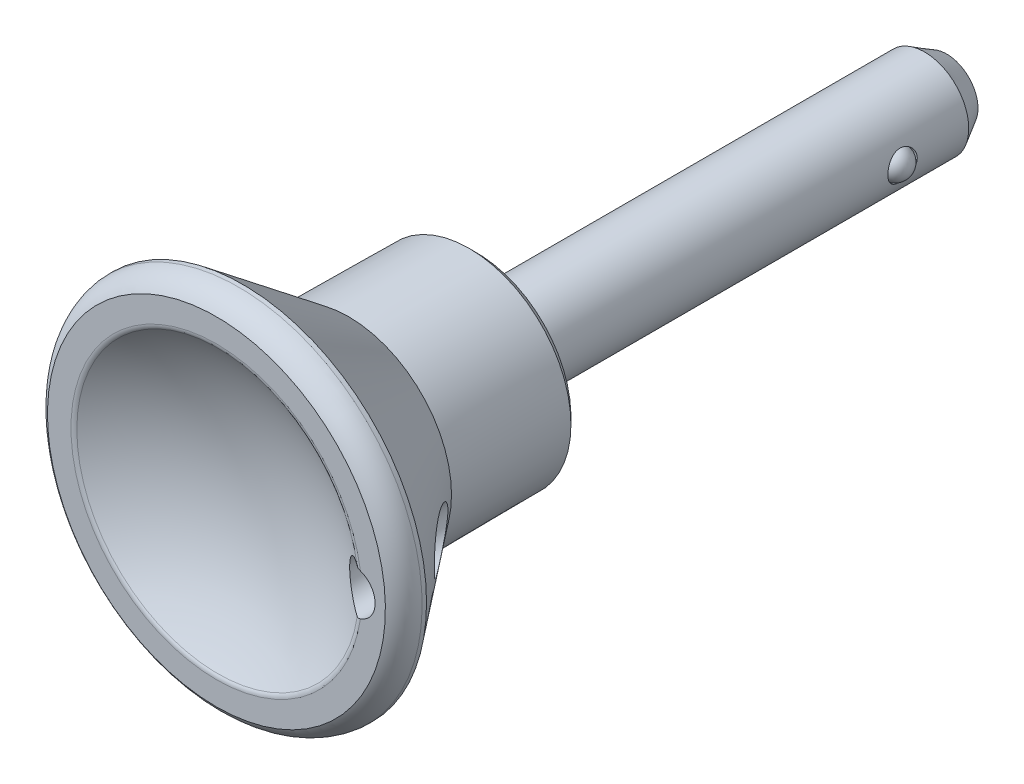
ISO-10303-21;
HEADER;
FILE_DESCRIPTION(('STEP AP214'),'2;1');
FILE_NAME('part.step','',(''),(''),'','','');
FILE_SCHEMA(('AUTOMOTIVE_DESIGN { 1 0 10303 214 1 1 1 1 }'));
ENDSEC;
DATA;
#1=APPLICATION_CONTEXT('core data for automotive mechanical design processes');
#2=APPLICATION_PROTOCOL_DEFINITION('international standard','automotive_design',2000,#1);
#3=PRODUCT_CONTEXT('',#1,'mechanical');
#4=PRODUCT('Part','Part','',(#3));
#5=PRODUCT_RELATED_PRODUCT_CATEGORY('part','',(#4));
#6=PRODUCT_DEFINITION_FORMATION('','',#4);
#7=PRODUCT_DEFINITION_CONTEXT('part definition',#1,'design');
#8=PRODUCT_DEFINITION('design','',#6,#7);
#9=PRODUCT_DEFINITION_SHAPE('','',#8);
#10=(LENGTH_UNIT() NAMED_UNIT(*) SI_UNIT(.MILLI.,.METRE.));
#11=(NAMED_UNIT(*) PLANE_ANGLE_UNIT() SI_UNIT($,.RADIAN.));
#12=(NAMED_UNIT(*) SI_UNIT($,.STERADIAN.) SOLID_ANGLE_UNIT());
#13=UNCERTAINTY_MEASURE_WITH_UNIT(LENGTH_MEASURE(1.E-05),#10,'distance_accuracy_value','');
#14=(GEOMETRIC_REPRESENTATION_CONTEXT(3) GLOBAL_UNCERTAINTY_ASSIGNED_CONTEXT((#13)) GLOBAL_UNIT_ASSIGNED_CONTEXT((#10,
#11,#12)) REPRESENTATION_CONTEXT('',''));
#15=CARTESIAN_POINT('',(0.,0.,0.));
#16=DIRECTION('',(0.,0.,1.));
#17=DIRECTION('',(1.,0.,0.));
#18=AXIS2_PLACEMENT_3D('',#15,#16,#17);
#19=CARTESIAN_POINT('',(0.,0.,0.));
#20=DIRECTION('',(0.,0.,1.));
#21=DIRECTION('',(0.,-1.,0.));
#22=AXIS2_PLACEMENT_3D('',#19,#20,#21);
#23=CYLINDRICAL_SURFACE('',#22,3.);
#24=CARTESIAN_POINT('',(0.,0.,0.));
#25=DIRECTION('',(0.,0.,1.));
#26=DIRECTION('',(0.,-1.,0.));
#27=AXIS2_PLACEMENT_3D('',#24,#25,#26);
#28=CIRCLE('',#27,3.);
#29=CARTESIAN_POINT('',(0.,-3.,0.));
#30=VERTEX_POINT('',#29);
#31=EDGE_CURVE('E17',#30,#30,#28,.T.);
#32=ORIENTED_EDGE('',*,*,#31,.F.);
#33=EDGE_LOOP('',(#32));
#34=FACE_BOUND('',#33,.T.);
#35=CARTESIAN_POINT('',(0.,0.,-30.5));
#36=DIRECTION('',(0.,0.,1.));
#37=DIRECTION('',(1.,0.,0.));
#38=AXIS2_PLACEMENT_3D('',#35,#36,#37);
#39=CIRCLE('',#38,3.);
#40=CARTESIAN_POINT('',(3.,0.,-30.5));
#41=VERTEX_POINT('',#40);
#42=EDGE_CURVE('E106',#41,#41,#39,.T.);
#43=ORIENTED_EDGE('',*,*,#42,.T.);
#44=EDGE_LOOP('',(#43));
#45=FACE_BOUND('',#44,.T.);
#46=CARTESIAN_POINT('',(3.,0.,-27.));
#47=CARTESIAN_POINT('',(2.99999782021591,-0.0544873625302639,-26.9999969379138));
#48=CARTESIAN_POINT('',(2.99849945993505,-0.10903081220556,-26.9955259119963));
#49=CARTESIAN_POINT('',(2.99265949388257,-0.21656775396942,-26.9777925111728));
#50=CARTESIAN_POINT('',(2.98831315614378,-0.269558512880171,-26.9645155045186));
#51=CARTESIAN_POINT('',(2.9772520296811,-0.372338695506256,-26.9296777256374));
#52=CARTESIAN_POINT('',(2.97054267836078,-0.42213516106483,-26.9081359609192));
#53=CARTESIAN_POINT('',(2.95544181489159,-0.517390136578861,-26.8574495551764));
#54=CARTESIAN_POINT('',(2.94705050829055,-0.562849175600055,-26.8283058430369));
#55=CARTESIAN_POINT('',(2.9291411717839,-0.649740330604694,-26.7621750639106));
#56=CARTESIAN_POINT('',(2.9195960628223,-0.691001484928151,-26.7249707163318));
#57=CARTESIAN_POINT('',(2.90060364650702,-0.766830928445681,-26.6442351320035));
#58=CARTESIAN_POINT('',(2.89115636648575,-0.801397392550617,-26.6007021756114));
#59=CARTESIAN_POINT('',(2.87313330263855,-0.863825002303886,-26.5070147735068));
#60=CARTESIAN_POINT('',(2.86459035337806,-0.891464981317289,-26.4567060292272));
#61=CARTESIAN_POINT('',(2.84975302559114,-0.937818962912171,-26.3518236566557));
#62=CARTESIAN_POINT('',(2.84345795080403,-0.956535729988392,-26.29725135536));
#63=CARTESIAN_POINT('',(2.83411303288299,-0.983873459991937,-26.187326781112));
#64=CARTESIAN_POINT('',(2.83096095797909,-0.992813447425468,-26.1320627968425));
#65=CARTESIAN_POINT('',(2.82795656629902,-1.00134112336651,-26.020736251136));
#66=CARTESIAN_POINT('',(2.82810323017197,-1.00093170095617,-25.9646739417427));
#67=CARTESIAN_POINT('',(2.83159014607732,-0.991019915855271,-25.8560634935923));
#68=CARTESIAN_POINT('',(2.83478414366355,-0.981933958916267,-25.8034718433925));
#69=CARTESIAN_POINT('',(2.84376655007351,-0.95560624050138,-25.7006068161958));
#70=CARTESIAN_POINT('',(2.84955528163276,-0.938363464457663,-25.6503337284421));
#71=CARTESIAN_POINT('',(2.8631792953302,-0.895938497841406,-25.5525859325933));
#72=CARTESIAN_POINT('',(2.87104608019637,-0.870632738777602,-25.5051694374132));
#73=CARTESIAN_POINT('',(2.88792606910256,-0.812887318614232,-25.4151267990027));
#74=CARTESIAN_POINT('',(2.89693954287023,-0.780445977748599,-25.3725017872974));
#75=CARTESIAN_POINT('',(2.91567165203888,-0.707355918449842,-25.2909155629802));
#76=CARTESIAN_POINT('',(2.92540257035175,-0.666367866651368,-25.2522605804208));
#77=CARTESIAN_POINT('',(2.94406631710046,-0.5783549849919,-25.1822794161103));
#78=CARTESIAN_POINT('',(2.95299879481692,-0.53132752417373,-25.1509564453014));
#79=CARTESIAN_POINT('',(2.96917806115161,-0.431907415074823,-25.0962803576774));
#80=CARTESIAN_POINT('',(2.97640595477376,-0.379463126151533,-25.073015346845));
#81=CARTESIAN_POINT('',(2.98821351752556,-0.271163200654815,-25.0357719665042));
#82=CARTESIAN_POINT('',(2.99279860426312,-0.215314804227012,-25.0217745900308));
#83=CARTESIAN_POINT('',(2.99719039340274,-0.13245787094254,-25.0084544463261));
#84=CARTESIAN_POINT('',(2.99824082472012,-0.106081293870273,-25.0052879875));
#85=CARTESIAN_POINT('',(2.9996461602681,-0.0531409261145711,-25.0010600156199));
#86=CARTESIAN_POINT('',(3.00000106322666,-0.0265771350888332,-24.9999985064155));
#87=CARTESIAN_POINT('',(2.99999782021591,0.0544873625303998,-25.0000030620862));
#88=CARTESIAN_POINT('',(2.99849945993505,0.109030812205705,-25.0044740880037));
#89=CARTESIAN_POINT('',(2.99265949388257,0.216567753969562,-25.0222074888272));
#90=CARTESIAN_POINT('',(2.98831315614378,0.269558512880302,-25.0354844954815));
#91=CARTESIAN_POINT('',(2.9772520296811,0.372338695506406,-25.0703222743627));
#92=CARTESIAN_POINT('',(2.97054267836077,0.422135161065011,-25.0918640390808));
#93=CARTESIAN_POINT('',(2.95544181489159,0.517390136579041,-25.1425504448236));
#94=CARTESIAN_POINT('',(2.94705050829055,0.562849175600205,-25.1716941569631));
#95=CARTESIAN_POINT('',(2.9291411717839,0.649740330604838,-25.2378249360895));
#96=CARTESIAN_POINT('',(2.91959606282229,0.691001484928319,-25.2750292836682));
#97=CARTESIAN_POINT('',(2.90060364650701,0.76683092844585,-25.3557648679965));
#98=CARTESIAN_POINT('',(2.89115636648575,0.801397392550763,-25.3992978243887));
#99=CARTESIAN_POINT('',(2.87313330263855,0.863825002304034,-25.4929852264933));
#100=CARTESIAN_POINT('',(2.86459035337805,0.891464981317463,-25.5432939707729));
#101=CARTESIAN_POINT('',(2.84975302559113,0.937818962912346,-25.6481763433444));
#102=CARTESIAN_POINT('',(2.84345795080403,0.956535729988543,-25.7027486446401));
#103=CARTESIAN_POINT('',(2.834113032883,0.983873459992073,-25.8126732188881));
#104=CARTESIAN_POINT('',(2.83096095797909,0.992813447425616,-25.8679372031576));
#105=CARTESIAN_POINT('',(2.82795656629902,1.00134112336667,-25.9792637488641));
#106=CARTESIAN_POINT('',(2.82810323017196,1.00093170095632,-26.0353260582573));
#107=CARTESIAN_POINT('',(2.83159014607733,0.991019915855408,-26.1439365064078));
#108=CARTESIAN_POINT('',(2.83478414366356,0.98193395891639,-26.1965281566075));
#109=CARTESIAN_POINT('',(2.84376655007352,0.955606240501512,-26.2993931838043));
#110=CARTESIAN_POINT('',(2.84955528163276,0.938363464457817,-26.349666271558));
#111=CARTESIAN_POINT('',(2.86317929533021,0.895938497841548,-26.4474140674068));
#112=CARTESIAN_POINT('',(2.87104608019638,0.870632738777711,-26.4948305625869));
#113=CARTESIAN_POINT('',(2.88792606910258,0.812887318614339,-26.5848732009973));
#114=CARTESIAN_POINT('',(2.89693954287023,0.780445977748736,-26.6274982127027));
#115=CARTESIAN_POINT('',(2.91567165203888,0.707355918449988,-26.7090844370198));
#116=CARTESIAN_POINT('',(2.92540257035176,0.666367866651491,-26.7477394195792));
#117=CARTESIAN_POINT('',(2.94406631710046,0.578354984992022,-26.8177205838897));
#118=CARTESIAN_POINT('',(2.95299879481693,0.531327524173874,-26.8490435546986));
#119=CARTESIAN_POINT('',(2.96917806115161,0.431907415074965,-26.9037196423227));
#120=CARTESIAN_POINT('',(2.97640595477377,0.37946312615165,-26.926984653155));
#121=CARTESIAN_POINT('',(2.98821351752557,0.271163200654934,-26.9642280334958));
#122=CARTESIAN_POINT('',(2.99279860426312,0.215314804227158,-26.9782254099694));
#123=CARTESIAN_POINT('',(2.99719039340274,0.132457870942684,-26.991545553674));
#124=CARTESIAN_POINT('',(2.99824082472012,0.106081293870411,-26.9947120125));
#125=CARTESIAN_POINT('',(2.9996461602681,0.0531409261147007,-26.9989399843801));
#126=CARTESIAN_POINT('',(3.00000106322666,0.0265771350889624,-27.0000014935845));
#127=CARTESIAN_POINT('',(3.,0.,-27.));
#128=B_SPLINE_CURVE_WITH_KNOTS('',3,(#46,#47,#48,#49,#50,#51,#52,#53,#54,#55,#56,#57,#58,#59,
#60,#61,#62,#63,#64,#65,#66,#67,#68,#69,#70,#71,#72,#73,#74,#75,#76,#77,#78,#79,#80,#81,#82,#83,
#84,#85,#86,#87,#88,#89,#90,#91,#92,#93,#94,#95,#96,#97,#98,#99,#100,#101,#102,#103,#104,#105,
#106,#107,#108,#109,#110,#111,#112,#113,#114,#115,#116,#117,#118,#119,#120,#121,#122,#123,#124,
#125,#126,#127),.UNSPECIFIED.,.T.,.F.,(4,2,2,2,2,2,2,2,2,2,2,2,2,2,2,2,2,2,2,2,2,2,2,2,2,2,2,2,
2,2,2,2,2,2,2,2,2,2,2,2,4),(0.,0.163359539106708,0.326991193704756,0.490248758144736,
0.653486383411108,0.8218424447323,0.990244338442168,1.16348424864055,1.33667045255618,
1.50401925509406,1.6713163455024,1.83096789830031,1.99063931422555,2.152886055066,
2.3151710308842,2.4859039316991,2.65671146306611,2.82933165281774,3.00159671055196,
3.08127795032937,3.16095933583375,3.32431887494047,3.48795052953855,3.65120809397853,
3.81444571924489,3.98280178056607,4.15120367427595,4.32444358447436,4.49762978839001,
4.66497859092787,4.83227568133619,4.99192723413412,5.15159865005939,5.31384539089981,
5.47613036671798,5.64686326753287,5.81767079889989,5.99029098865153,6.16255604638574,
6.24223728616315,6.32191867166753),.UNSPECIFIED.);
#129=CARTESIAN_POINT('',(3.,0.,-27.));
#130=VERTEX_POINT('',#129);
#131=EDGE_CURVE('E142',#130,#130,#128,.T.);
#132=ORIENTED_EDGE('',*,*,#131,.T.);
#133=EDGE_LOOP('',(#132));
#134=FACE_BOUND('',#133,.T.);
#135=ADVANCED_FACE('F14',(#34,#45,#134),#23,.T.);
#136=CARTESIAN_POINT('',(6.4240762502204,-6.50116727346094,0.));
#137=DIRECTION('',(0.,0.,-1.));
#138=DIRECTION('',(-1.,0.,0.));
#139=AXIS2_PLACEMENT_3D('',#136,#137,#138);
#140=PLANE('',#139);
#141=ORIENTED_EDGE('',*,*,#31,.T.);
#142=EDGE_LOOP('',(#141));
#143=FACE_BOUND('',#142,.T.);
#144=CARTESIAN_POINT('',(0.,0.,0.));
#145=DIRECTION('',(0.,0.,1.));
#146=DIRECTION('',(0.,-1.,0.));
#147=AXIS2_PLACEMENT_3D('',#144,#145,#146);
#148=CIRCLE('',#147,6.4240762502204);
#149=CARTESIAN_POINT('',(0.,-6.4240762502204,0.));
#150=VERTEX_POINT('',#149);
#151=EDGE_CURVE('E94',#150,#150,#148,.T.);
#152=ORIENTED_EDGE('',*,*,#151,.F.);
#153=EDGE_LOOP('',(#152));
#154=FACE_BOUND('',#153,.T.);
#155=ADVANCED_FACE('F166',(#143,#154),#140,.T.);
#156=CARTESIAN_POINT('',(0.,0.,0.));
#157=DIRECTION('',(0.,0.,1.));
#158=DIRECTION('',(0.,-1.,0.));
#159=AXIS2_PLACEMENT_3D('',#156,#157,#158);
#160=CONICAL_SURFACE('',#159,6.4240762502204,0.789761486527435);
#161=CARTESIAN_POINT('',(0.,0.,0.49998096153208));
#162=DIRECTION('',(0.,0.,-1.));
#163=DIRECTION('',(1.,0.,0.));
#164=AXIS2_PLACEMENT_3D('',#161,#162,#163);
#165=CIRCLE('',#164,6.92843951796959);
#166=CARTESIAN_POINT('',(6.92843951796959,0.,0.49998096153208));
#167=VERTEX_POINT('',#166);
#168=EDGE_CURVE('E123',#167,#167,#165,.F.);
#169=ORIENTED_EDGE('',*,*,#168,.F.);
#170=EDGE_LOOP('',(#169));
#171=FACE_BOUND('',#170,.T.);
#172=ORIENTED_EDGE('',*,*,#151,.T.);
#173=EDGE_LOOP('',(#172));
#174=FACE_BOUND('',#173,.T.);
#175=ADVANCED_FACE('F171',(#171,#174),#160,.T.);
#176=CARTESIAN_POINT('',(0.,0.,0.49998096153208));
#177=DIRECTION('',(0.,0.,1.));
#178=DIRECTION('',(0.,-1.,0.));
#179=AXIS2_PLACEMENT_3D('',#176,#177,#178);
#180=CONICAL_SURFACE('',#179,6.92843951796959,0.00872664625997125);
#181=CARTESIAN_POINT('',(0.,0.,8.7));
#182=DIRECTION('',(0.,0.,-1.));
#183=DIRECTION('',(1.,0.,0.));
#184=AXIS2_PLACEMENT_3D('',#181,#182,#183);
#185=CIRCLE('',#184,7.);
#186=CARTESIAN_POINT('',(7.,0.,8.7));
#187=VERTEX_POINT('',#186);
#188=EDGE_CURVE('E119',#187,#187,#185,.F.);
#189=ORIENTED_EDGE('',*,*,#188,.F.);
#190=EDGE_LOOP('',(#189));
#191=FACE_BOUND('',#190,.T.);
#192=ORIENTED_EDGE('',*,*,#168,.T.);
#193=EDGE_LOOP('',(#192));
#194=FACE_BOUND('',#193,.T.);
#195=ADVANCED_FACE('F180',(#191,#194),#180,.T.);
#196=CARTESIAN_POINT('',(0.,0.,16.2));
#197=DIRECTION('',(0.,0.,1.));
#198=DIRECTION('',(0.,-1.,0.));
#199=AXIS2_PLACEMENT_3D('',#196,#197,#198);
#200=CYLINDRICAL_SURFACE('',#199,12.5);
#201=CARTESIAN_POINT('',(0.,0.,15.9));
#202=DIRECTION('',(0.,0.,-1.));
#203=DIRECTION('',(1.,0.,0.));
#204=AXIS2_PLACEMENT_3D('',#201,#202,#203);
#205=CIRCLE('',#204,12.5);
#206=CARTESIAN_POINT('',(12.5,0.,15.9));
#207=VERTEX_POINT('',#206);
#208=EDGE_CURVE('E120',#207,#207,#205,.T.);
#209=ORIENTED_EDGE('',*,*,#208,.F.);
#210=EDGE_LOOP('',(#209));
#211=FACE_BOUND('',#210,.T.);
#212=CARTESIAN_POINT('',(0.,0.,16.2));
#213=DIRECTION('',(0.,0.,1.));
#214=DIRECTION('',(0.,-1.,0.));
#215=AXIS2_PLACEMENT_3D('',#212,#213,#214);
#216=CIRCLE('',#215,12.5);
#217=CARTESIAN_POINT('',(0.,-12.5000000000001,16.2));
#218=VERTEX_POINT('',#217);
#219=EDGE_CURVE('E93',#218,#218,#216,.T.);
#220=ORIENTED_EDGE('',*,*,#219,.F.);
#221=EDGE_LOOP('',(#220));
#222=FACE_BOUND('',#221,.T.);
#223=ADVANCED_FACE('F187',(#211,#222),#200,.T.);
#224=CARTESIAN_POINT('',(0.,0.,8.7));
#225=DIRECTION('',(0.,0.,1.));
#226=DIRECTION('',(0.,-1.,0.));
#227=AXIS2_PLACEMENT_3D('',#224,#225,#226);
#228=CONICAL_SURFACE('',#227,7.,0.65233090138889);
#229=CARTESIAN_POINT('',(9.05806451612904,-1.48036050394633,11.5515077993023));
#230=CARTESIAN_POINT('',(8.99141512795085,-1.4694682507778,11.4631001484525));
#231=CARTESIAN_POINT('',(8.92550148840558,-1.4540855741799,11.3746905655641));
#232=CARTESIAN_POINT('',(8.79556366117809,-1.4142717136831,11.1984472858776));
#233=CARTESIAN_POINT('',(8.73154031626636,-1.38983655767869,11.1106138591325));
#234=CARTESIAN_POINT('',(8.60623315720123,-1.33170423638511,10.936758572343));
#235=CARTESIAN_POINT('',(8.54493725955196,-1.29805393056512,10.8507298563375));
#236=CARTESIAN_POINT('',(8.42544336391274,-1.22074353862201,10.6811358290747));
#237=CARTESIAN_POINT('',(8.36724184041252,-1.17709515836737,10.5975677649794));
#238=CARTESIAN_POINT('',(8.26922940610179,-1.0911470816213,10.4552980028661));
#239=CARTESIAN_POINT('',(8.22852162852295,-1.0513568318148,10.3957022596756));
#240=CARTESIAN_POINT('',(8.14989980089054,-0.964725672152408,10.2796936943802));
#241=CARTESIAN_POINT('',(8.11198828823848,-0.917878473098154,10.2232837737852));
#242=CARTESIAN_POINT('',(8.03963417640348,-0.815744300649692,10.1148327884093));
#243=CARTESIAN_POINT('',(8.00522654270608,-0.760383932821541,10.0628364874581));
#244=CARTESIAN_POINT('',(7.94192848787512,-0.640477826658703,9.96655825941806));
#245=CARTESIAN_POINT('',(7.91302454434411,-0.575955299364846,9.92225744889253));
#246=CARTESIAN_POINT('',(7.87251252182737,-0.463057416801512,9.85986137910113));
#247=CARTESIAN_POINT('',(7.85846623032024,-0.41757382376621,9.83814176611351));
#248=CARTESIAN_POINT('',(7.83441768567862,-0.32315293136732,9.80086955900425));
#249=CARTESIAN_POINT('',(7.82440740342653,-0.274222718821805,9.78530472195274));
#250=CARTESIAN_POINT('',(7.81132335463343,-0.187620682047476,9.76493500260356));
#251=CARTESIAN_POINT('',(7.80710048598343,-0.150537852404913,9.75835039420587));
#252=CARTESIAN_POINT('',(7.80143783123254,-0.0756412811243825,9.74951765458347));
#253=CARTESIAN_POINT('',(7.79999798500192,-0.0378275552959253,9.74726942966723));
#254=CARTESIAN_POINT('',(7.8000025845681,0.0485200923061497,9.74727695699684));
#255=CARTESIAN_POINT('',(7.80237736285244,0.0970629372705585,9.75098545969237));
#256=CARTESIAN_POINT('',(7.81164444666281,0.192651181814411,9.76543406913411));
#257=CARTESIAN_POINT('',(7.81854204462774,0.239694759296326,9.77618241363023));
#258=CARTESIAN_POINT('',(7.83829683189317,0.341610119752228,9.80688772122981));
#259=CARTESIAN_POINT('',(7.85215507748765,0.395817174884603,9.82838678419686));
#260=CARTESIAN_POINT('',(7.88451983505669,0.499375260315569,9.87838349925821));
#261=CARTESIAN_POINT('',(7.90303499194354,0.548717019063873,9.90689416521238));
#262=CARTESIAN_POINT('',(7.95423062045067,0.667068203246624,9.98533549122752));
#263=CARTESIAN_POINT('',(7.9892435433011,0.732796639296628,10.0386516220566));
#264=CARTESIAN_POINT('',(8.06472209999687,0.85393242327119,10.1525776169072));
#265=CARTESIAN_POINT('',(8.10520064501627,0.909314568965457,10.2132047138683));
#266=CARTESIAN_POINT('',(8.18383548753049,1.00367842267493,10.3298982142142));
#267=CARTESIAN_POINT('',(8.22147534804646,1.04387385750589,10.3853483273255));
#268=CARTESIAN_POINT('',(8.29898008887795,1.11841530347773,10.4986148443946));
#269=CARTESIAN_POINT('',(8.33884646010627,1.15275733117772,10.556432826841));
#270=CARTESIAN_POINT('',(8.42042546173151,1.21614962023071,10.6737908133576));
#271=CARTESIAN_POINT('',(8.46214099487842,1.24519116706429,10.7333334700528));
#272=CARTESIAN_POINT('',(8.54706483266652,1.29830522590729,10.8535675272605));
#273=CARTESIAN_POINT('',(8.59027353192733,1.32237641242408,10.9142592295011));
#274=CARTESIAN_POINT('',(8.69675324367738,1.3751305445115,11.0626135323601));
#275=CARTESIAN_POINT('',(8.76068198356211,1.40136483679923,11.150681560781));
#276=CARTESIAN_POINT('',(8.89058399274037,1.44466814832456,11.3275915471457));
#277=CARTESIAN_POINT('',(8.95655819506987,1.4617329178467,11.4164338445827));
#278=CARTESIAN_POINT('',(9.09008194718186,1.48679092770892,11.5942301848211));
#279=CARTESIAN_POINT('',(9.15763151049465,1.49478409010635,11.683184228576));
#280=CARTESIAN_POINT('',(9.293788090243,1.50153429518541,11.8605390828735));
#281=CARTESIAN_POINT('',(9.36239469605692,1.50029483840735,11.9489400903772));
#282=CARTESIAN_POINT('',(9.53896432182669,1.48478544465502,12.1740527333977));
#283=CARTESIAN_POINT('',(9.64741582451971,1.46359594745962,12.3100469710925));
#284=CARTESIAN_POINT('',(9.80896256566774,1.41213790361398,12.5095339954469));
#285=CARTESIAN_POINT('',(9.86259038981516,1.39172486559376,12.5752398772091));
#286=CARTESIAN_POINT('',(9.96902195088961,1.343806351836,12.7046889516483));
#287=CARTESIAN_POINT('',(10.021826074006,1.31630431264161,12.7684330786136));
#288=CARTESIAN_POINT('',(10.1398540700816,1.24522266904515,12.9099256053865));
#289=CARTESIAN_POINT('',(10.2046458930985,1.19931241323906,12.9868895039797));
#290=CARTESIAN_POINT('',(10.3299573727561,1.0935701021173,13.1345591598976));
#291=CARTESIAN_POINT('',(10.3904821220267,1.0337550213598,13.2052724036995));
#292=CARTESIAN_POINT('',(10.4895745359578,0.916081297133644,13.3202576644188));
#293=CARTESIAN_POINT('',(10.5297805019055,0.861692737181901,13.3666468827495));
#294=CARTESIAN_POINT('',(10.6043536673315,0.743973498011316,13.452316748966));
#295=CARTESIAN_POINT('',(10.6387288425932,0.680655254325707,13.4916071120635));
#296=CARTESIAN_POINT('',(10.6925693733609,0.560424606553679,13.5529446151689));
#297=CARTESIAN_POINT('',(10.7136506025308,0.50520820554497,13.5768833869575));
#298=CARTESIAN_POINT('',(10.7495749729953,0.390302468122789,13.6176027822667));
#299=CARTESIAN_POINT('',(10.7644289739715,0.330621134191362,13.6343958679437));
#300=CARTESIAN_POINT('',(10.7836092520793,0.225596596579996,13.656059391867));
#301=CARTESIAN_POINT('',(10.7897268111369,0.180990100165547,13.6629607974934));
#302=CARTESIAN_POINT('',(10.7979243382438,0.0909301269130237,13.6722061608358));
#303=CARTESIAN_POINT('',(10.8000037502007,0.0454765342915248,13.6745494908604));
#304=CARTESIAN_POINT('',(10.799994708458,-0.0641674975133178,13.6745397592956));
#305=CARTESIAN_POINT('',(10.795841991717,-0.128380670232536,13.6698606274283));
#306=CARTESIAN_POINT('',(10.7796239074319,-0.254506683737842,13.6515601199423));
#307=CARTESIAN_POINT('',(10.7675483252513,-0.316416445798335,13.6379272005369));
#308=CARTESIAN_POINT('',(10.7366563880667,-0.435644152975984,13.6029693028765));
#309=CARTESIAN_POINT('',(10.7178919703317,-0.49299342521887,13.5817035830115));
#310=CARTESIAN_POINT('',(10.6748799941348,-0.602645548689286,13.532811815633));
#311=CARTESIAN_POINT('',(10.6506301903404,-0.654946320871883,13.5051831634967));
#312=CARTESIAN_POINT('',(10.5859735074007,-0.776472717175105,13.4312530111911));
#313=CARTESIAN_POINT('',(10.5432056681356,-0.84272820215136,13.3821425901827));
#314=CARTESIAN_POINT('',(10.4516580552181,-0.96409991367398,13.2763616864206));
#315=CARTESIAN_POINT('',(10.4028645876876,-1.01918998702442,13.2196739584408));
#316=CARTESIAN_POINT('',(10.2766029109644,-1.14345503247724,13.0719673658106));
#317=CARTESIAN_POINT('',(10.1967753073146,-1.20635475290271,12.9777102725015));
#318=CARTESIAN_POINT('',(10.0329696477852,-1.31236147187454,12.7820645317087));
#319=CARTESIAN_POINT('',(9.94898466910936,-1.35543413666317,12.6806638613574));
#320=CARTESIAN_POINT('',(9.79718248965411,-1.41705079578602,12.4951419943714));
#321=CARTESIAN_POINT('',(9.72964852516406,-1.43883766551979,12.4118303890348));
#322=CARTESIAN_POINT('',(9.59439459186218,-1.47247845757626,12.2433068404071));
#323=CARTESIAN_POINT('',(9.52667453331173,-1.48432617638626,12.1580937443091));
#324=CARTESIAN_POINT('',(9.39151350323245,-1.49875216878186,11.9862568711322));
#325=CARTESIAN_POINT('',(9.32407407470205,-1.50130123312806,11.8996295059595));
#326=CARTESIAN_POINT('',(9.19020636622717,-1.49747387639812,11.725837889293));
#327=CARTESIAN_POINT('',(9.12377782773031,-1.49109977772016,11.6386737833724));
#328=CARTESIAN_POINT('',(9.05806451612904,-1.48036050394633,11.5515077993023));
#329=B_SPLINE_CURVE_WITH_KNOTS('',3,(#229,#230,#231,#232,#233,#234,#235,#236,#237,#238,#239,
#240,#241,#242,#243,#244,#245,#246,#247,#248,#249,#250,#251,#252,#253,#254,#255,#256,#257,#258,
#259,#260,#261,#262,#263,#264,#265,#266,#267,#268,#269,#270,#271,#272,#273,#274,#275,#276,#277,
#278,#279,#280,#281,#282,#283,#284,#285,#286,#287,#288,#289,#290,#291,#292,#293,#294,#295,#296,
#297,#298,#299,#300,#301,#302,#303,#304,#305,#306,#307,#308,#309,#310,#311,#312,#313,#314,#315,
#316,#317,#318,#319,#320,#321,#322,#323,#324,#325,#326,#327,#328),.UNSPECIFIED.,.T.,.F.,(4,2,2,
2,2,2,2,2,2,2,2,2,2,2,2,2,2,2,2,2,2,2,2,2,2,2,2,2,2,2,2,2,2,2,2,2,2,2,2,2,2,2,2,2,2,2,2,2,2,4),
(0.,0.333658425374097,0.667463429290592,0.999601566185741,1.33135280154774,1.5782678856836,
1.8254043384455,2.07480511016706,2.32358497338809,2.48005639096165,2.63621497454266,
2.74958301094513,2.86294859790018,3.00835870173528,3.1539392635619,3.33275537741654,
3.51190592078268,3.78514778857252,4.05904679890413,4.29316938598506,4.52745067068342,
4.76211373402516,4.99683929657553,5.33221840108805,5.6677528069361,6.00329009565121,
6.33870017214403,6.8622621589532,7.12372139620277,7.38505412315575,7.71589293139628,
8.04632996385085,8.29159071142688,8.53651321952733,8.72709088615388,8.91733480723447,
9.0535973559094,9.18987866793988,9.38217192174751,9.57471358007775,9.76579164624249,
9.95694806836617,10.2340958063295,10.5118854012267,10.9254412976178,11.3397106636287,
11.6675345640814,11.995562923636,12.3246208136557,12.6535930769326),.UNSPECIFIED.);
#330=CARTESIAN_POINT('',(9.05806451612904,-1.48036050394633,11.5515077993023));
#331=VERTEX_POINT('',#330);
#332=EDGE_CURVE('E49',#331,#331,#329,.T.);
#333=ORIENTED_EDGE('',*,*,#332,.F.);
#334=EDGE_LOOP('',(#333));
#335=FACE_BOUND('',#334,.T.);
#336=ORIENTED_EDGE('',*,*,#208,.T.);
#337=EDGE_LOOP('',(#336));
#338=FACE_BOUND('',#337,.T.);
#339=ORIENTED_EDGE('',*,*,#188,.T.);
#340=EDGE_LOOP('',(#339));
#341=FACE_BOUND('',#340,.T.);
#342=ADVANCED_FACE('F190',(#335,#338,#341),#228,.T.);
#343=CARTESIAN_POINT('',(0.,0.,15.9596620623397));
#344=DIRECTION('',(0.,0.,1.));
#345=DIRECTION('',(0.,-1.,0.));
#346=AXIS2_PLACEMENT_3D('',#343,#344,#345);
#347=TOROIDAL_SURFACE('',#346,10.5144930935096,2.);
#348=ORIENTED_EDGE('',*,*,#219,.T.);
#349=EDGE_LOOP('',(#348));
#350=FACE_BOUND('',#349,.T.);
#351=CARTESIAN_POINT('',(0.,0.,17.7));
#352=DIRECTION('',(0.,0.,1.));
#353=DIRECTION('',(0.,-1.,0.));
#354=AXIS2_PLACEMENT_3D('',#351,#352,#353);
#355=CIRCLE('',#354,11.5);
#356=CARTESIAN_POINT('',(0.,-11.5000000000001,17.7));
#357=VERTEX_POINT('',#356);
#358=EDGE_CURVE('E53',#357,#357,#355,.T.);
#359=ORIENTED_EDGE('',*,*,#358,.F.);
#360=EDGE_LOOP('',(#359));
#361=FACE_BOUND('',#360,.T.);
#362=ADVANCED_FACE('F78',(#350,#361),#347,.T.);
#363=CARTESIAN_POINT('',(9.3,0.,9.74688245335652));
#364=DIRECTION('',(0.,0.,1.));
#365=DIRECTION('',(0.,-1.,0.));
#366=AXIS2_PLACEMENT_3D('',#363,#364,#365);
#367=CYLINDRICAL_SURFACE('',#366,1.5);
#368=ORIENTED_EDGE('',*,*,#332,.T.);
#369=EDGE_LOOP('',(#368));
#370=FACE_BOUND('',#369,.T.);
#371=CARTESIAN_POINT('',(9.79838709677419,-1.41478277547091,17.7));
#372=CARTESIAN_POINT('',(9.76967463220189,-1.42493393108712,17.7000278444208));
#373=CARTESIAN_POINT('',(9.74057958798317,-1.43416331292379,17.6978154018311));
#374=CARTESIAN_POINT('',(9.68339626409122,-1.45046247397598,17.688811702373));
#375=CARTESIAN_POINT('',(9.65530246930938,-1.45758512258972,17.6821493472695));
#376=CARTESIAN_POINT('',(9.60265119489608,-1.46937623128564,17.6649718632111));
#377=CARTESIAN_POINT('',(9.57800180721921,-1.47420693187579,17.6548534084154));
#378=CARTESIAN_POINT('',(9.52973678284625,-1.48251466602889,17.6305344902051));
#379=CARTESIAN_POINT('',(9.50616459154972,-1.4859533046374,17.6162348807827));
#380=CARTESIAN_POINT('',(9.48387096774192,-1.48868783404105,17.6));
#381=B_SPLINE_CURVE_WITH_KNOTS('',3,(#371,#372,#373,#374,#375,#376,#377,#378,#379,#380),
.UNSPECIFIED.,.F.,.F.,(4,2,2,2,4),(0.,0.091347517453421,0.18015749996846,0.261045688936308,
0.344033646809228),.UNSPECIFIED.);
#382=CARTESIAN_POINT('',(9.79838709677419,-1.41478277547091,17.7));
#383=VERTEX_POINT('',#382);
#384=CARTESIAN_POINT('',(9.48387096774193,-1.48868783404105,17.6));
#385=VERTEX_POINT('',#384);
#386=EDGE_CURVE('E42',#383,#385,#381,.T.);
#387=ORIENTED_EDGE('',*,*,#386,.F.);
#388=CARTESIAN_POINT('',(9.3,0.,17.7));
#389=DIRECTION('',(0.,0.,1.));
#390=DIRECTION('',(0.,-1.,0.));
#391=AXIS2_PLACEMENT_3D('',#388,#389,#390);
#392=CIRCLE('',#391,1.5);
#393=CARTESIAN_POINT('',(9.79838709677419,1.41478277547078,17.7));
#394=VERTEX_POINT('',#393);
#395=EDGE_CURVE('E30',#394,#383,#392,.F.);
#396=ORIENTED_EDGE('',*,*,#395,.F.);
#397=CARTESIAN_POINT('',(9.79838709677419,1.41478277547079,17.7));
#398=CARTESIAN_POINT('',(9.76967463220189,1.424933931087,17.7000278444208));
#399=CARTESIAN_POINT('',(9.74057958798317,1.43416331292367,17.6978154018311));
#400=CARTESIAN_POINT('',(9.68339626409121,1.45046247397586,17.688811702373));
#401=CARTESIAN_POINT('',(9.65530246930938,1.45758512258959,17.6821493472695));
#402=CARTESIAN_POINT('',(9.60265119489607,1.46937623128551,17.6649718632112));
#403=CARTESIAN_POINT('',(9.5780018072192,1.47420693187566,17.6548534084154));
#404=CARTESIAN_POINT('',(9.52973678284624,1.48251466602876,17.6305344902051));
#405=CARTESIAN_POINT('',(9.50616459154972,1.48595330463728,17.6162348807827));
#406=CARTESIAN_POINT('',(9.48387096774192,1.48868783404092,17.6));
#407=B_SPLINE_CURVE_WITH_KNOTS('',3,(#397,#398,#399,#400,#401,#402,#403,#404,#405,#406),
.UNSPECIFIED.,.F.,.F.,(4,2,2,2,4),(0.,0.0913475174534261,0.180157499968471,0.261045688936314,
0.344033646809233),.UNSPECIFIED.);
#408=CARTESIAN_POINT('',(9.48387096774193,1.48868783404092,17.6));
#409=VERTEX_POINT('',#408);
#410=EDGE_CURVE('E43',#394,#409,#407,.T.);
#411=ORIENTED_EDGE('',*,*,#410,.T.);
#412=CARTESIAN_POINT('',(9.48387096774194,-1.48868783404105,17.6));
#413=CARTESIAN_POINT('',(9.38181447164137,-1.50126046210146,17.5258231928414));
#414=CARTESIAN_POINT('',(9.27847034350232,-1.50339409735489,17.4514075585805));
#415=CARTESIAN_POINT('',(9.07150168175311,-1.48616897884,17.3036113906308));
#416=CARTESIAN_POINT('',(8.96788247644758,-1.46662385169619,17.230245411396));
#417=CARTESIAN_POINT('',(8.76570217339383,-1.40554015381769,17.0882393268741));
#418=CARTESIAN_POINT('',(8.66709675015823,-1.36425592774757,17.0195547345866));
#419=CARTESIAN_POINT('',(8.47807170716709,-1.25938003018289,16.8888158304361));
#420=CARTESIAN_POINT('',(8.38761877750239,-1.19588484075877,16.8267343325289));
#421=CARTESIAN_POINT('',(8.24568836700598,-1.06979552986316,16.7298945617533));
#422=CARTESIAN_POINT('',(8.19079097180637,-1.0129559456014,16.692612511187));
#423=CARTESIAN_POINT('',(8.08925811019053,-0.889102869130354,16.6238983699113));
#424=CARTESIAN_POINT('',(8.04262373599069,-0.822088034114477,16.5924670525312));
#425=CARTESIAN_POINT('',(7.95961243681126,-0.678453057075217,16.5366671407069));
#426=CARTESIAN_POINT('',(7.9233211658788,-0.60175988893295,16.5123574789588));
#427=CARTESIAN_POINT('',(7.86387797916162,-0.441385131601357,16.4726071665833));
#428=CARTESIAN_POINT('',(7.84069382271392,-0.357721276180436,16.4571447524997));
#429=CARTESIAN_POINT('',(7.81665644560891,-0.227526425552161,16.4411240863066));
#430=CARTESIAN_POINT('',(7.81042627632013,-0.182354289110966,16.4369745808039));
#431=CARTESIAN_POINT('',(7.80209606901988,-0.091465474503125,16.4314273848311));
#432=CARTESIAN_POINT('',(7.79999581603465,-0.0457488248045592,16.4300295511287));
#433=CARTESIAN_POINT('',(7.8000067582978,0.0738974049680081,16.4300365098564));
#434=CARTESIAN_POINT('',(7.80550430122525,0.147878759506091,16.4336949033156));
#435=CARTESIAN_POINT('',(7.82172596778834,0.25704761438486,16.4445026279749));
#436=CARTESIAN_POINT('',(7.82847272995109,0.293170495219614,16.4489987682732));
#437=CARTESIAN_POINT('',(7.84452794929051,0.364609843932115,16.4597055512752));
#438=CARTESIAN_POINT('',(7.85383787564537,0.399925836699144,16.4659171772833));
#439=CARTESIAN_POINT('',(7.88533418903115,0.50392626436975,16.4869492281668));
#440=CARTESIAN_POINT('',(7.91114789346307,0.571060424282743,16.5042071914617));
#441=CARTESIAN_POINT('',(7.97122958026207,0.699580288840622,16.5444764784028));
#442=CARTESIAN_POINT('',(8.00550445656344,0.760961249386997,16.5674924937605));
#443=CARTESIAN_POINT('',(8.06330229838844,0.849663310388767,16.6064232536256));
#444=CARTESIAN_POINT('',(8.08431449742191,0.879441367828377,16.6205962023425));
#445=CARTESIAN_POINT('',(8.12808579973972,0.936974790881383,16.6501700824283));
#446=CARTESIAN_POINT('',(8.15084283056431,0.96473248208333,16.6655695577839));
#447=CARTESIAN_POINT('',(8.22150377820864,1.0449510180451,16.7134720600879));
#448=CARTESIAN_POINT('',(8.27178709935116,1.09434151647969,16.7476721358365));
#449=CARTESIAN_POINT('',(8.38550726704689,1.19170689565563,16.8253434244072));
#450=CARTESIAN_POINT('',(8.44976642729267,1.23822096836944,16.8694253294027));
#451=CARTESIAN_POINT('',(8.5828769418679,1.31978473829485,16.961227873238));
#452=CARTESIAN_POINT('',(8.65173257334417,1.35482357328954,17.0089519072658));
#453=CARTESIAN_POINT('',(8.76337185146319,1.40144242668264,17.0867690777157));
#454=CARTESIAN_POINT('',(8.80522580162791,1.41674274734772,17.1160369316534));
#455=CARTESIAN_POINT('',(8.88962205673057,1.44344948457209,17.1752539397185));
#456=CARTESIAN_POINT('',(8.93216367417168,1.45485956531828,17.2052024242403));
#457=CARTESIAN_POINT('',(9.06048356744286,1.48334429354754,17.2958544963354));
#458=CARTESIAN_POINT('',(9.14699642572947,1.49468964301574,17.3573922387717));
#459=CARTESIAN_POINT('',(9.31725275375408,1.50223877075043,17.4793658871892));
#460=CARTESIAN_POINT('',(9.40099551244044,1.49891929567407,17.5397732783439));
#461=CARTESIAN_POINT('',(9.48387096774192,1.48868783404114,17.6));
#462=B_SPLINE_CURVE_WITH_KNOTS('',3,(#412,#413,#414,#415,#416,#417,#418,#419,#420,#421,#422,
#423,#424,#425,#426,#427,#428,#429,#430,#431,#432,#433,#434,#435,#436,#437,#438,#439,#440,#441,
#442,#443,#444,#445,#446,#447,#448,#449,#450,#451,#452,#453,#454,#455,#456,#457,#458,#459,#460,
#461),.UNSPECIFIED.,.F.,.F.,(4,2,2,2,2,2,2,2,2,2,2,2,2,2,2,2,2,2,2,2,2,2,2,2,4),(0.,
0.3801739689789,0.763641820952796,1.14271969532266,1.52017093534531,1.7812816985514,
2.04242694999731,2.30567583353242,2.5682743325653,2.70539664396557,2.84251181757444,
3.06399194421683,3.17494513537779,3.2859620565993,3.50680011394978,3.72781870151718,
3.8450322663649,3.96210870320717,4.19632161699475,4.46759731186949,4.73912905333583,
4.89893578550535,5.05859157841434,5.37775215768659,5.6866146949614),.UNSPECIFIED.);
#463=EDGE_CURVE('E48',#385,#409,#462,.T.);
#464=ORIENTED_EDGE('',*,*,#463,.F.);
#465=EDGE_LOOP('',(#387,#396,#411,#464));
#466=FACE_BOUND('',#465,.T.);
#467=ADVANCED_FACE('F46',(#370,#466),#367,.F.);
#468=CARTESIAN_POINT('',(0.,-1.06141094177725E-13,30.4));
#469=DIRECTION('',(0.,-1.,0.));
#470=DIRECTION('',(0.,0.,1.));
#471=AXIS2_PLACEMENT_3D('',#468,#469,#470);
#472=SPHERICAL_SURFACE('',#471,16.);
#473=ORIENTED_EDGE('',*,*,#463,.T.);
#474=CARTESIAN_POINT('',(0.,0.,17.6));
#475=DIRECTION('',(0.,0.,1.));
#476=DIRECTION('',(0.,-1.,0.));
#477=AXIS2_PLACEMENT_3D('',#474,#475,#476);
#478=CIRCLE('',#477,9.6);
#479=EDGE_CURVE('E23',#385,#409,#478,.F.);
#480=ORIENTED_EDGE('',*,*,#479,.F.);
#481=EDGE_LOOP('',(#473,#480));
#482=FACE_BOUND('',#481,.T.);
#483=ADVANCED_FACE('F71',(#482),#472,.F.);
#484=CARTESIAN_POINT('',(-11.73,-11.5,17.7));
#485=CARTESIAN_POINT('',(-11.5,-11.5,17.7));
#486=CARTESIAN_POINT('',(11.5,-11.5,17.7));
#487=B_SPLINE_CURVE_WITH_KNOTS('',1,(#484,#485,#486),.UNSPECIFIED.,.F.,.F.,(2,1,2),(-0.01,0.,
1.),.UNSPECIFIED.);
#488=DIRECTION('',(0.,1.,0.));
#489=VECTOR('',#488,1.);
#490=SURFACE_OF_LINEAR_EXTRUSION('',#487,#489);
#491=ORIENTED_EDGE('',*,*,#395,.T.);
#492=CARTESIAN_POINT('',(0.,0.,17.7));
#493=DIRECTION('',(0.,0.,1.));
#494=DIRECTION('',(0.,-1.,0.));
#495=AXIS2_PLACEMENT_3D('',#492,#493,#494);
#496=CIRCLE('',#495,9.9);
#497=EDGE_CURVE('E9',#394,#383,#496,.T.);
#498=ORIENTED_EDGE('',*,*,#497,.F.);
#499=EDGE_LOOP('',(#491,#498));
#500=FACE_BOUND('',#499,.T.);
#501=ORIENTED_EDGE('',*,*,#358,.T.);
#502=EDGE_LOOP('',(#501));
#503=FACE_BOUND('',#502,.T.);
#504=ADVANCED_FACE('F51',(#500,#503),#490,.T.);
#505=CARTESIAN_POINT('',(0.,0.,17.2));
#506=DIRECTION('',(0.,0.,1.));
#507=DIRECTION('',(0.,-1.,0.));
#508=AXIS2_PLACEMENT_3D('',#505,#506,#507);
#509=TOROIDAL_SURFACE('',#508,9.89999999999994,0.50000000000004);
#510=ORIENTED_EDGE('',*,*,#410,.F.);
#511=ORIENTED_EDGE('',*,*,#497,.T.);
#512=ORIENTED_EDGE('',*,*,#386,.T.);
#513=ORIENTED_EDGE('',*,*,#479,.T.);
#514=EDGE_LOOP('',(#510,#511,#512,#513));
#515=FACE_BOUND('',#514,.T.);
#516=ADVANCED_FACE('F40',(#515),#509,.T.);
#517=CARTESIAN_POINT('',(2.49,0.,-26.));
#518=DIRECTION('',(0.,-1.,0.));
#519=DIRECTION('',(0.,0.,-1.));
#520=AXIS2_PLACEMENT_3D('',#517,#518,#519);
#521=SPHERICAL_SURFACE('',#520,1.01);
#522=CARTESIAN_POINT('',(2.63177446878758,0.,-26.));
#523=DIRECTION('',(1.,0.,0.));
#524=DIRECTION('',(0.,-1.,0.));
#525=AXIS2_PLACEMENT_3D('',#522,#523,#524);
#526=CIRCLE('',#525,1.);
#527=CARTESIAN_POINT('',(2.63177446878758,-0.999999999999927,-26.));
#528=VERTEX_POINT('',#527);
#529=EDGE_CURVE('E133',#528,#528,#526,.F.);
#530=ORIENTED_EDGE('',*,*,#529,.F.);
#531=EDGE_LOOP('',(#530));
#532=FACE_BOUND('',#531,.T.);
#533=ADVANCED_FACE('F99',(#532),#521,.T.);
#534=CARTESIAN_POINT('',(2.13397459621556,-2.15958441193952,-32.));
#535=DIRECTION('',(0.,0.,-1.));
#536=DIRECTION('',(-1.,0.,0.));
#537=AXIS2_PLACEMENT_3D('',#534,#535,#536);
#538=PLANE('',#537);
#539=CARTESIAN_POINT('',(0.,0.,-32.));
#540=DIRECTION('',(0.,0.,1.));
#541=DIRECTION('',(0.,-1.,0.));
#542=AXIS2_PLACEMENT_3D('',#539,#540,#541);
#543=CIRCLE('',#542,2.13397459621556);
#544=CARTESIAN_POINT('',(0.,-2.13397459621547,-32.));
#545=VERTEX_POINT('',#544);
#546=EDGE_CURVE('E137',#545,#545,#543,.T.);
#547=ORIENTED_EDGE('',*,*,#546,.F.);
#548=EDGE_LOOP('',(#547));
#549=FACE_BOUND('',#548,.T.);
#550=ADVANCED_FACE('F156',(#549),#538,.T.);
#551=CARTESIAN_POINT('',(2.63177446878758,0.,-26.));
#552=DIRECTION('',(1.,0.,0.));
#553=DIRECTION('',(0.,-1.,0.));
#554=AXIS2_PLACEMENT_3D('',#551,#552,#553);
#555=CYLINDRICAL_SURFACE('',#554,1.);
#556=ORIENTED_EDGE('',*,*,#529,.T.);
#557=EDGE_LOOP('',(#556));
#558=FACE_BOUND('',#557,.T.);
#559=ORIENTED_EDGE('',*,*,#131,.F.);
#560=EDGE_LOOP('',(#559));
#561=FACE_BOUND('',#560,.T.);
#562=ADVANCED_FACE('F151',(#558,#561),#555,.F.);
#563=CARTESIAN_POINT('',(0.,0.,-32.));
#564=DIRECTION('',(0.,0.,1.));
#565=DIRECTION('',(0.,-1.,0.));
#566=AXIS2_PLACEMENT_3D('',#563,#564,#565);
#567=CONICAL_SURFACE('',#566,2.13397459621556,0.523598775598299);
#568=ORIENTED_EDGE('',*,*,#42,.F.);
#569=EDGE_LOOP('',(#568));
#570=FACE_BOUND('',#569,.T.);
#571=ORIENTED_EDGE('',*,*,#546,.T.);
#572=EDGE_LOOP('',(#571));
#573=FACE_BOUND('',#572,.T.);
#574=ADVANCED_FACE('F155',(#570,#573),#567,.T.);
#575=CLOSED_SHELL('',(#135,#155,#175,#195,#223,#342,#362,#467,#483,#504,#516,#533,#550,#562,#574));
#576=MANIFOLD_SOLID_BREP('B1',#575);
#577=ADVANCED_BREP_SHAPE_REPRESENTATION('',(#18,#576),#14);
#578=SHAPE_DEFINITION_REPRESENTATION(#9,#577);
ENDSEC;
END-ISO-10303-21;
